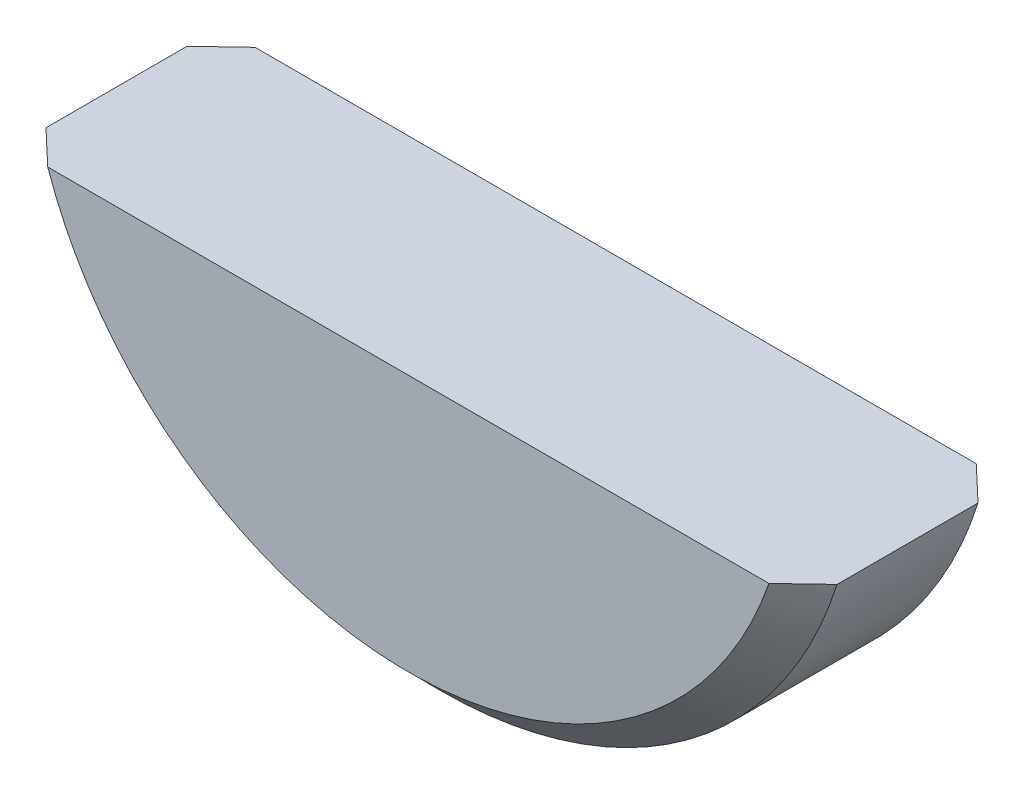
ISO-10303-21;
HEADER;
FILE_DESCRIPTION(('STEP AP214'),'2;1');
FILE_NAME('part.step','',(''),(''),'','','');
FILE_SCHEMA(('AUTOMOTIVE_DESIGN { 1 0 10303 214 1 1 1 1 }'));
ENDSEC;
DATA;
#1=APPLICATION_CONTEXT('core data for automotive mechanical design processes');
#2=APPLICATION_PROTOCOL_DEFINITION('international standard','automotive_design',2000,#1);
#3=PRODUCT_CONTEXT('',#1,'mechanical');
#4=PRODUCT('Part','Part','',(#3));
#5=PRODUCT_RELATED_PRODUCT_CATEGORY('part','',(#4));
#6=PRODUCT_DEFINITION_FORMATION('','',#4);
#7=PRODUCT_DEFINITION_CONTEXT('part definition',#1,'design');
#8=PRODUCT_DEFINITION('design','',#6,#7);
#9=PRODUCT_DEFINITION_SHAPE('','',#8);
#10=(LENGTH_UNIT() NAMED_UNIT(*) SI_UNIT(.MILLI.,.METRE.));
#11=(NAMED_UNIT(*) PLANE_ANGLE_UNIT() SI_UNIT($,.RADIAN.));
#12=(NAMED_UNIT(*) SI_UNIT($,.STERADIAN.) SOLID_ANGLE_UNIT());
#13=UNCERTAINTY_MEASURE_WITH_UNIT(LENGTH_MEASURE(1.E-05),#10,'distance_accuracy_value','');
#14=(GEOMETRIC_REPRESENTATION_CONTEXT(3) GLOBAL_UNCERTAINTY_ASSIGNED_CONTEXT((#13)) GLOBAL_UNIT_ASSIGNED_CONTEXT((#10,
#11,#12)) REPRESENTATION_CONTEXT('',''));
#15=CARTESIAN_POINT('',(0.,0.,0.));
#16=DIRECTION('',(0.,0.,1.));
#17=DIRECTION('',(1.,0.,0.));
#18=AXIS2_PLACEMENT_3D('',#15,#16,#17);
#19=CARTESIAN_POINT('',(0.,0.6,1.));
#20=DIRECTION('',(0.,0.,-1.));
#21=DIRECTION('',(-1.,0.,0.));
#22=AXIS2_PLACEMENT_3D('',#19,#20,#21);
#23=CYLINDRICAL_SURFACE('',#22,2.);
#24=DIRECTION('',(0.,0.,-1.));
#25=VECTOR('',#24,1.);
#26=CARTESIAN_POINT('',(-1.90787840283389,0.,1.));
#27=LINE('',#26,#25);
#28=CARTESIAN_POINT('',(-1.90787840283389,0.,0.839999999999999));
#29=VERTEX_POINT('',#28);
#30=CARTESIAN_POINT('',(-1.90787840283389,0.,0.16));
#31=VERTEX_POINT('',#30);
#32=EDGE_CURVE('E87',#29,#31,#27,.T.);
#33=ORIENTED_EDGE('',*,*,#32,.T.);
#34=CARTESIAN_POINT('',(0.,0.6,0.16));
#35=DIRECTION('',(0.,0.,1.));
#36=DIRECTION('',(1.,0.,0.));
#37=AXIS2_PLACEMENT_3D('',#34,#35,#36);
#38=CIRCLE('',#37,2.);
#39=CARTESIAN_POINT('',(1.90787840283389,0.,0.16));
#40=VERTEX_POINT('',#39);
#41=EDGE_CURVE('E86',#31,#40,#38,.T.);
#42=ORIENTED_EDGE('',*,*,#41,.T.);
#43=DIRECTION('',(0.,0.,-1.));
#44=VECTOR('',#43,1.);
#45=CARTESIAN_POINT('',(1.90787840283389,0.,1.));
#46=LINE('',#45,#44);
#47=CARTESIAN_POINT('',(1.90787840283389,0.,0.839999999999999));
#48=VERTEX_POINT('',#47);
#49=EDGE_CURVE('E77',#48,#40,#46,.T.);
#50=ORIENTED_EDGE('',*,*,#49,.F.);
#51=CARTESIAN_POINT('',(0.,0.6,0.839999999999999));
#52=DIRECTION('',(0.,0.,1.));
#53=DIRECTION('',(1.,0.,0.));
#54=AXIS2_PLACEMENT_3D('',#51,#52,#53);
#55=CIRCLE('',#54,2.);
#56=EDGE_CURVE('E84',#48,#29,#55,.F.);
#57=ORIENTED_EDGE('',*,*,#56,.T.);
#58=EDGE_LOOP('',(#33,#42,#50,#57));
#59=FACE_BOUND('',#58,.T.);
#60=ADVANCED_FACE('F33',(#59),#23,.T.);
#61=CARTESIAN_POINT('',(-1.90787840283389,0.,1.));
#62=DIRECTION('',(0.,-1.,0.));
#63=DIRECTION('',(0.,0.,-1.));
#64=AXIS2_PLACEMENT_3D('',#61,#62,#63);
#65=PLANE('',#64);
#66=ORIENTED_EDGE('',*,*,#49,.T.);
#67=CARTESIAN_POINT('',(1.90787840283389,0.,0.16));
#68=CARTESIAN_POINT('',(1.87986304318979,0.,0.133269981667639));
#69=CARTESIAN_POINT('',(1.85181759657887,0.,0.106571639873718));
#70=CARTESIAN_POINT('',(1.79566652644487,0.,0.0532383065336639));
#71=CARTESIAN_POINT('',(1.76756090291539,0.,0.0266033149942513));
#72=CARTESIAN_POINT('',(1.73942519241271,0.,0.));
#73=B_SPLINE_CURVE_WITH_KNOTS('',3,(#67,#68,#69,#70,#71,#72),.UNSPECIFIED.,.F.,.F.,(4,2,4),(0.,
0.116164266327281,0.232328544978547),.UNSPECIFIED.);
#74=CARTESIAN_POINT('',(1.73942519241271,0.,0.));
#75=VERTEX_POINT('',#74);
#76=EDGE_CURVE('E118',#40,#75,#73,.T.);
#77=ORIENTED_EDGE('',*,*,#76,.T.);
#78=DIRECTION('',(-1.,0.,0.));
#79=VECTOR('',#78,1.);
#80=CARTESIAN_POINT('',(-1.90787840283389,0.,0.));
#81=LINE('',#80,#79);
#82=CARTESIAN_POINT('',(-1.73942519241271,0.,0.));
#83=VERTEX_POINT('',#82);
#84=EDGE_CURVE('E177',#75,#83,#81,.T.);
#85=ORIENTED_EDGE('',*,*,#84,.T.);
#86=CARTESIAN_POINT('',(-1.73942519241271,0.,0.));
#87=CARTESIAN_POINT('',(-1.76756090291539,0.,0.0266033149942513));
#88=CARTESIAN_POINT('',(-1.79566652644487,0.,0.0532383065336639));
#89=CARTESIAN_POINT('',(-1.85181759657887,0.,0.106571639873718));
#90=CARTESIAN_POINT('',(-1.87986304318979,0.,0.133269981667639));
#91=CARTESIAN_POINT('',(-1.90787840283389,0.,0.16));
#92=B_SPLINE_CURVE_WITH_KNOTS('',3,(#86,#87,#88,#89,#90,#91),.UNSPECIFIED.,.F.,.F.,(4,2,4),(0.,
0.116164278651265,0.232328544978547),.UNSPECIFIED.);
#93=EDGE_CURVE('E79',#83,#31,#92,.T.);
#94=ORIENTED_EDGE('',*,*,#93,.T.);
#95=ORIENTED_EDGE('',*,*,#32,.F.);
#96=CARTESIAN_POINT('',(-1.90787840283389,0.,0.839999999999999));
#97=CARTESIAN_POINT('',(-1.87986304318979,0.,0.86673001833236));
#98=CARTESIAN_POINT('',(-1.85181759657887,0.,0.893428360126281));
#99=CARTESIAN_POINT('',(-1.79566652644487,0.,0.946761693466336));
#100=CARTESIAN_POINT('',(-1.76756090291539,0.,0.973396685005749));
#101=CARTESIAN_POINT('',(-1.73942519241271,0.,1.));
#102=B_SPLINE_CURVE_WITH_KNOTS('',3,(#96,#97,#98,#99,#100,#101),.UNSPECIFIED.,.F.,.F.,(4,2,4),
(0.,0.116164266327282,0.232328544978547),.UNSPECIFIED.);
#103=CARTESIAN_POINT('',(-1.73942519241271,0.,1.));
#104=VERTEX_POINT('',#103);
#105=EDGE_CURVE('E49',#29,#104,#102,.T.);
#106=ORIENTED_EDGE('',*,*,#105,.T.);
#107=DIRECTION('',(-1.,0.,0.));
#108=VECTOR('',#107,1.);
#109=CARTESIAN_POINT('',(-1.90787840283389,0.,1.));
#110=LINE('',#109,#108);
#111=CARTESIAN_POINT('',(1.73942519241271,0.,1.));
#112=VERTEX_POINT('',#111);
#113=EDGE_CURVE('E78',#112,#104,#110,.T.);
#114=ORIENTED_EDGE('',*,*,#113,.F.);
#115=CARTESIAN_POINT('',(1.73942519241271,0.,1.));
#116=CARTESIAN_POINT('',(1.76756090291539,0.,0.973396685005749));
#117=CARTESIAN_POINT('',(1.79566652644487,0.,0.946761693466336));
#118=CARTESIAN_POINT('',(1.85181759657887,0.,0.893428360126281));
#119=CARTESIAN_POINT('',(1.87986304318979,0.,0.86673001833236));
#120=CARTESIAN_POINT('',(1.90787840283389,0.,0.839999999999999));
#121=B_SPLINE_CURVE_WITH_KNOTS('',3,(#115,#116,#117,#118,#119,#120),.UNSPECIFIED.,.F.,.F.,(4,2,
4),(0.,0.116164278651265,0.232328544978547),.UNSPECIFIED.);
#122=EDGE_CURVE('E57',#112,#48,#121,.T.);
#123=ORIENTED_EDGE('',*,*,#122,.T.);
#124=EDGE_LOOP('',(#66,#77,#85,#94,#95,#106,#114,#123));
#125=FACE_BOUND('',#124,.T.);
#126=ADVANCED_FACE('F76',(#125),#65,.F.);
#127=CARTESIAN_POINT('',(0.,0.6,1.));
#128=DIRECTION('',(0.,0.,1.));
#129=DIRECTION('',(1.,0.,0.));
#130=AXIS2_PLACEMENT_3D('',#127,#128,#129);
#131=PLANE('',#130);
#132=ORIENTED_EDGE('',*,*,#113,.T.);
#133=CARTESIAN_POINT('',(0.,0.6,1.));
#134=DIRECTION('',(0.,0.,1.));
#135=DIRECTION('',(1.,0.,0.));
#136=AXIS2_PLACEMENT_3D('',#133,#134,#135);
#137=CIRCLE('',#136,1.84);
#138=EDGE_CURVE('E11',#104,#112,#137,.T.);
#139=ORIENTED_EDGE('',*,*,#138,.T.);
#140=EDGE_LOOP('',(#132,#139));
#141=FACE_BOUND('',#140,.T.);
#142=ADVANCED_FACE('F107',(#141),#131,.T.);
#143=CARTESIAN_POINT('',(0.,0.6,0.));
#144=DIRECTION('',(0.,0.,1.));
#145=DIRECTION('',(1.,0.,0.));
#146=AXIS2_PLACEMENT_3D('',#143,#144,#145);
#147=PLANE('',#146);
#148=ORIENTED_EDGE('',*,*,#84,.F.);
#149=CARTESIAN_POINT('',(0.,0.6,0.));
#150=DIRECTION('',(0.,0.,1.));
#151=DIRECTION('',(1.,0.,0.));
#152=AXIS2_PLACEMENT_3D('',#149,#150,#151);
#153=CIRCLE('',#152,1.84);
#154=EDGE_CURVE('E42',#75,#83,#153,.F.);
#155=ORIENTED_EDGE('',*,*,#154,.T.);
#156=EDGE_LOOP('',(#148,#155));
#157=FACE_BOUND('',#156,.T.);
#158=ADVANCED_FACE('F108',(#157),#147,.F.);
#159=CARTESIAN_POINT('',(0.,0.6,0.16));
#160=DIRECTION('',(0.,0.,1.));
#161=DIRECTION('',(1.,0.,0.));
#162=AXIS2_PLACEMENT_3D('',#159,#160,#161);
#163=CONICAL_SURFACE('',#162,2.,0.785398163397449);
#164=ORIENTED_EDGE('',*,*,#93,.F.);
#165=ORIENTED_EDGE('',*,*,#154,.F.);
#166=ORIENTED_EDGE('',*,*,#76,.F.);
#167=ORIENTED_EDGE('',*,*,#41,.F.);
#168=EDGE_LOOP('',(#164,#165,#166,#167));
#169=FACE_BOUND('',#168,.T.);
#170=ADVANCED_FACE('F123',(#169),#163,.T.);
#171=CARTESIAN_POINT('',(0.,0.6,1.));
#172=DIRECTION('',(0.,0.,-1.));
#173=DIRECTION('',(-1.,0.,0.));
#174=AXIS2_PLACEMENT_3D('',#171,#172,#173);
#175=CONICAL_SURFACE('',#174,1.84,0.785398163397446);
#176=ORIENTED_EDGE('',*,*,#105,.F.);
#177=ORIENTED_EDGE('',*,*,#56,.F.);
#178=ORIENTED_EDGE('',*,*,#122,.F.);
#179=ORIENTED_EDGE('',*,*,#138,.F.);
#180=EDGE_LOOP('',(#176,#177,#178,#179));
#181=FACE_BOUND('',#180,.T.);
#182=ADVANCED_FACE('F35',(#181),#175,.T.);
#183=CLOSED_SHELL('',(#60,#126,#142,#158,#170,#182));
#184=MANIFOLD_SOLID_BREP('B2',#183);
#185=ADVANCED_BREP_SHAPE_REPRESENTATION('',(#18,#184),#14);
#186=SHAPE_DEFINITION_REPRESENTATION(#9,#185);
ENDSEC;
END-ISO-10303-21;
